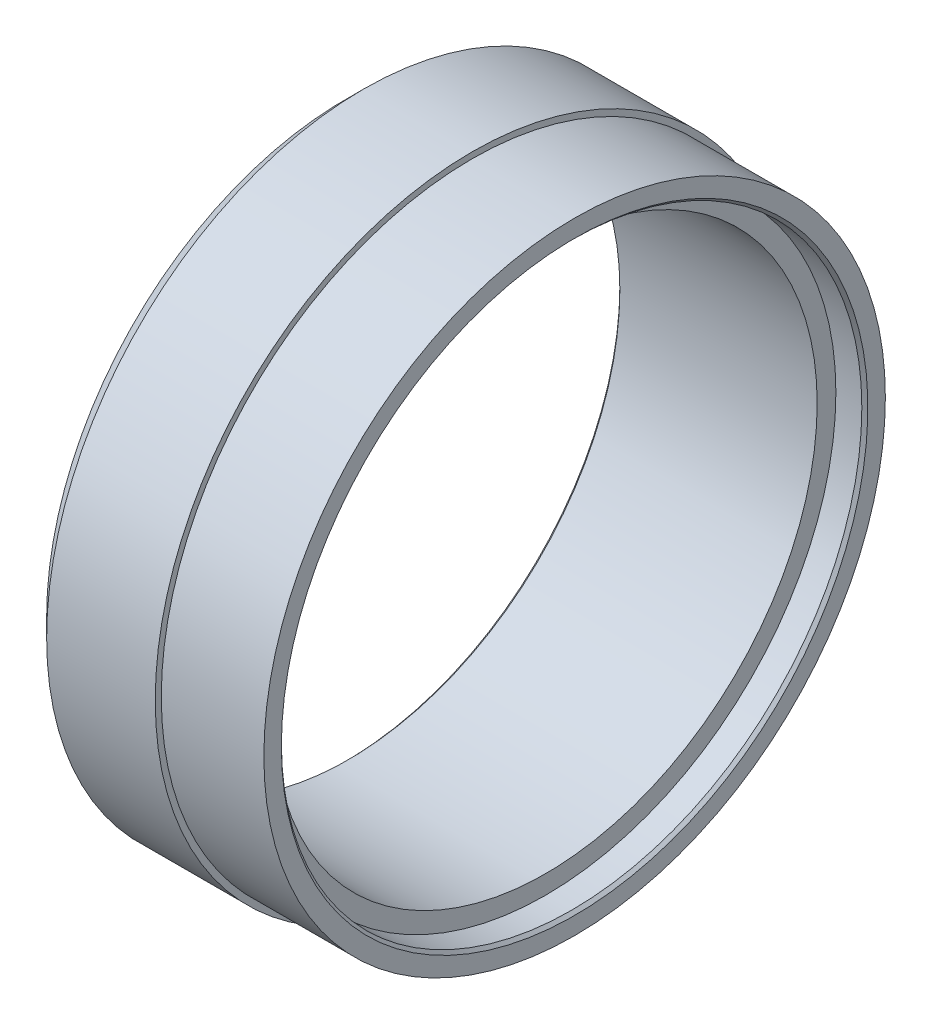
from build123d import *

# Parameters (mm, degrees)
CHANFREIN1_SIZE = 3
CHANFREIN2_SIZE = 0.5


with BuildPart() as part:
    # Esquisse1 → R_volution1 (revolve)
    with BuildSketch(Plane.XY, mode=Mode.PRIVATE) as r_volution1_sk:
        Polygon((0, 45), (0, 52.5), (21, 52.5), (21, 51.5), (38, 51.5), (38, 48.1), (33.2, 48.1), (33.2, 45), align=None)
    revolve(r_volution1_sk.sketch.rotate(Axis((0, 0, 0), (1, 0, 0)), 90), axis=Axis((0, 0, 0), (1, 0, 0)))

    # Chanfrein1
    chanfrein1_edges = [part.edges().sort_by_distance(p)[0] for p in [
        (0, 0, -52.5),
    ]]
    chamfer(chanfrein1_edges, length=CHANFREIN1_SIZE)

    # Chanfrein2
    chanfrein2_edges = [part.edges().sort_by_distance(p)[0] for p in [
        (0, 0, -45),
        (38, 0, -48.1),
    ]]
    chamfer(chanfrein2_edges, length=CHANFREIN2_SIZE)


solid = part.part
